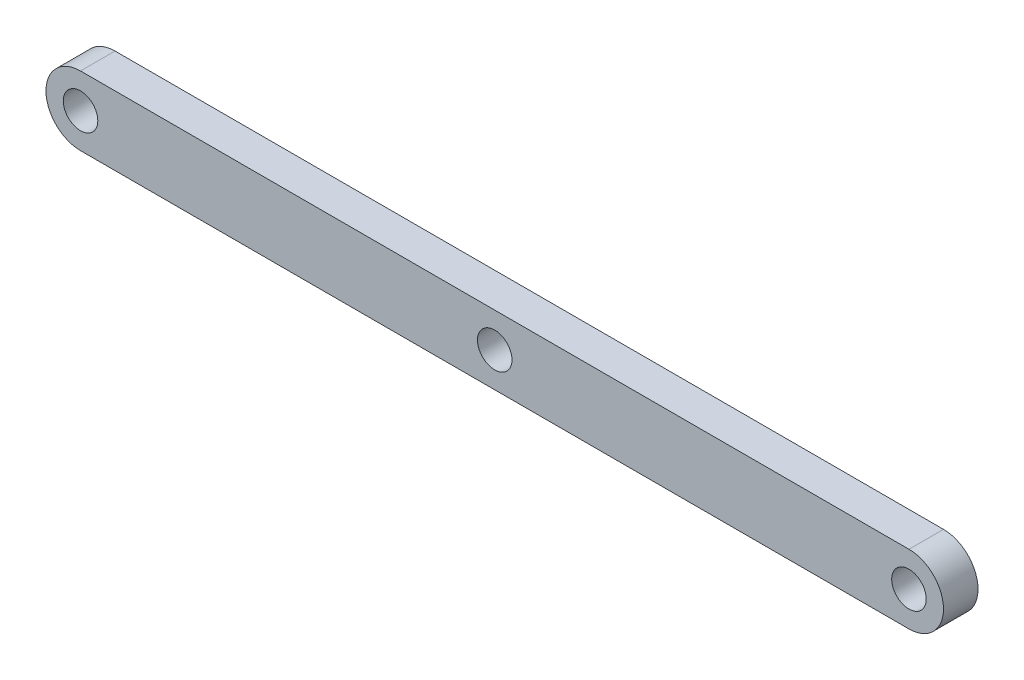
from build123d import *

# Parameters (mm, degrees)
SKETCH1_R           = 1.5875
BOSS_EXTRUDE1_DEPTH = 3.175


with BuildPart() as part:
    # Sketch1 → Boss-Extrude1 (new body)
    with BuildSketch(Plane.XY):
        with BuildLine():
            Line((0, 3.175), (76.2, 3.175))
            ThreePointArc((76.2, 3.175), (79.375, 0), (76.2, -3.175))
            Line((76.2, -3.175), (0, -3.175))
            ThreePointArc((0, -3.175), (-3.175, 0), (0, 3.175))
        make_face()
        Circle(SKETCH1_R, mode=Mode.SUBTRACT)
        with Locations((76.2, 0)):
            Circle(SKETCH1_R, mode=Mode.SUBTRACT)
        with Locations((38.1, 0)):
            Circle(SKETCH1_R, mode=Mode.SUBTRACT)
    extrude(amount=BOSS_EXTRUDE1_DEPTH)


solid = part.part
